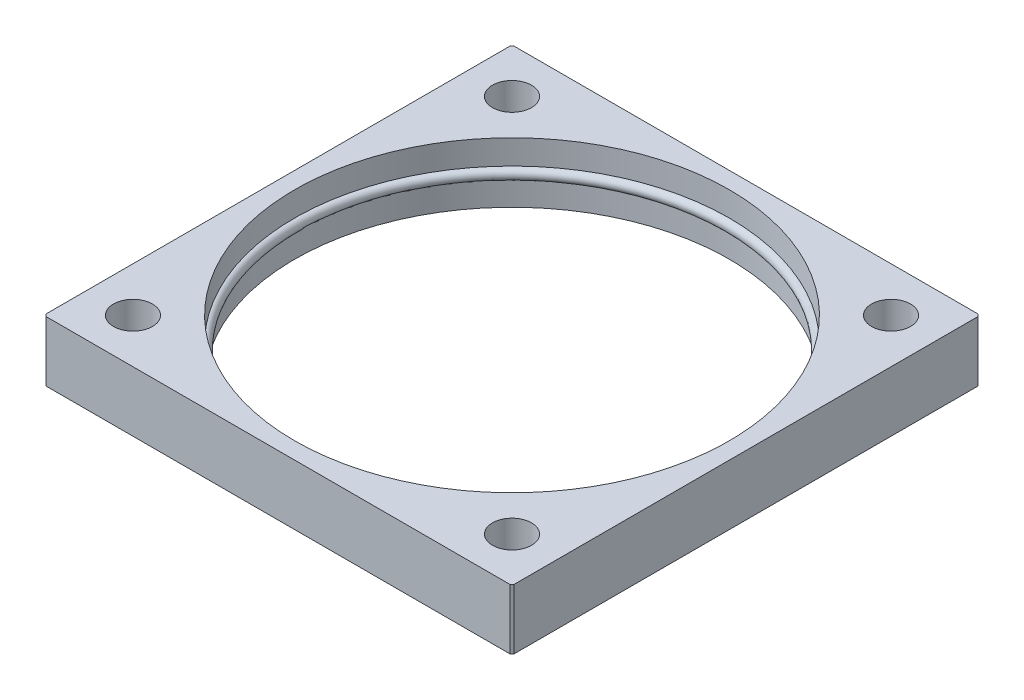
ISO-10303-21;
HEADER;
FILE_DESCRIPTION(('STEP AP214'),'2;1');
FILE_NAME('part.step','',(''),(''),'','','');
FILE_SCHEMA(('AUTOMOTIVE_DESIGN { 1 0 10303 214 1 1 1 1 }'));
ENDSEC;
DATA;
#1=APPLICATION_CONTEXT('core data for automotive mechanical design processes');
#2=APPLICATION_PROTOCOL_DEFINITION('international standard','automotive_design',2000,#1);
#3=PRODUCT_CONTEXT('',#1,'mechanical');
#4=PRODUCT('Part','Part','',(#3));
#5=PRODUCT_RELATED_PRODUCT_CATEGORY('part','',(#4));
#6=PRODUCT_DEFINITION_FORMATION('','',#4);
#7=PRODUCT_DEFINITION_CONTEXT('part definition',#1,'design');
#8=PRODUCT_DEFINITION('design','',#6,#7);
#9=PRODUCT_DEFINITION_SHAPE('','',#8);
#10=(LENGTH_UNIT() NAMED_UNIT(*) SI_UNIT(.MILLI.,.METRE.));
#11=(NAMED_UNIT(*) PLANE_ANGLE_UNIT() SI_UNIT($,.RADIAN.));
#12=(NAMED_UNIT(*) SI_UNIT($,.STERADIAN.) SOLID_ANGLE_UNIT());
#13=UNCERTAINTY_MEASURE_WITH_UNIT(LENGTH_MEASURE(1.E-05),#10,'distance_accuracy_value','');
#14=(GEOMETRIC_REPRESENTATION_CONTEXT(3) GLOBAL_UNCERTAINTY_ASSIGNED_CONTEXT((#13)) GLOBAL_UNIT_ASSIGNED_CONTEXT((#10,
#11,#12)) REPRESENTATION_CONTEXT('',''));
#15=CARTESIAN_POINT('',(0.,0.,0.));
#16=DIRECTION('',(0.,0.,1.));
#17=DIRECTION('',(1.,0.,0.));
#18=AXIS2_PLACEMENT_3D('',#15,#16,#17);
#19=CARTESIAN_POINT('',(0.,13.5,0.));
#20=DIRECTION('',(0.,-1.,0.));
#21=DIRECTION('',(0.,0.,-1.));
#22=AXIS2_PLACEMENT_3D('',#19,#20,#21);
#23=CYLINDRICAL_SURFACE('',#22,97.5);
#24=CARTESIAN_POINT('',(0.,-13.5,0.));
#25=DIRECTION('',(0.,1.,0.));
#26=DIRECTION('',(0.,0.,1.));
#27=AXIS2_PLACEMENT_3D('',#24,#25,#26);
#28=CIRCLE('',#27,97.5);
#29=CARTESIAN_POINT('',(0.,-13.5,97.5));
#30=VERTEX_POINT('',#29);
#31=EDGE_CURVE('E193',#30,#30,#28,.T.);
#32=ORIENTED_EDGE('',*,*,#31,.F.);
#33=EDGE_LOOP('',(#32));
#34=FACE_BOUND('',#33,.T.);
#35=CARTESIAN_POINT('',(0.,-2.5,0.));
#36=DIRECTION('',(0.,1.,0.));
#37=DIRECTION('',(0.,0.,1.));
#38=AXIS2_PLACEMENT_3D('',#35,#36,#37);
#39=CIRCLE('',#38,97.5);
#40=CARTESIAN_POINT('',(0.,-2.5,97.5));
#41=VERTEX_POINT('',#40);
#42=EDGE_CURVE('E39',#41,#41,#39,.T.);
#43=ORIENTED_EDGE('',*,*,#42,.T.);
#44=EDGE_LOOP('',(#43));
#45=FACE_BOUND('',#44,.T.);
#46=ADVANCED_FACE('F35',(#34,#45),#23,.F.);
#47=CARTESIAN_POINT('',(0.,13.5,0.));
#48=DIRECTION('',(0.,1.,0.));
#49=DIRECTION('',(0.,0.,1.));
#50=AXIS2_PLACEMENT_3D('',#47,#48,#49);
#51=CIRCLE('',#50,97.5);
#52=CARTESIAN_POINT('',(0.,13.5,97.5));
#53=VERTEX_POINT('',#52);
#54=EDGE_CURVE('E139',#53,#53,#51,.T.);
#55=ORIENTED_EDGE('',*,*,#54,.T.);
#56=EDGE_LOOP('',(#55));
#57=FACE_BOUND('',#56,.T.);
#58=CARTESIAN_POINT('',(0.,2.5,0.));
#59=DIRECTION('',(0.,-1.,0.));
#60=DIRECTION('',(0.,0.,-1.));
#61=AXIS2_PLACEMENT_3D('',#58,#59,#60);
#62=CIRCLE('',#61,97.5);
#63=CARTESIAN_POINT('',(0.,2.5,-97.5));
#64=VERTEX_POINT('',#63);
#65=EDGE_CURVE('E161',#64,#64,#62,.T.);
#66=ORIENTED_EDGE('',*,*,#65,.T.);
#67=EDGE_LOOP('',(#66));
#68=FACE_BOUND('',#67,.T.);
#69=ADVANCED_FACE('F237',(#57,#68),#23,.F.);
#70=CARTESIAN_POINT('',(0.,13.5,0.));
#71=DIRECTION('',(0.,1.,0.));
#72=DIRECTION('',(0.,0.,1.));
#73=AXIS2_PLACEMENT_3D('',#70,#71,#72);
#74=PLANE('',#73);
#75=CARTESIAN_POINT('',(85.,13.5,85.));
#76=DIRECTION('',(0.,1.,0.));
#77=DIRECTION('',(0.,0.,1.));
#78=AXIS2_PLACEMENT_3D('',#75,#76,#77);
#79=CIRCLE('',#78,8.75000000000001);
#80=CARTESIAN_POINT('',(85.,13.5,93.75));
#81=VERTEX_POINT('',#80);
#82=EDGE_CURVE('E178',#81,#81,#79,.T.);
#83=ORIENTED_EDGE('',*,*,#82,.F.);
#84=EDGE_LOOP('',(#83));
#85=FACE_BOUND('',#84,.T.);
#86=CARTESIAN_POINT('',(85.,13.5,-85.0000000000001));
#87=DIRECTION('',(0.,1.,0.));
#88=DIRECTION('',(0.,0.,1.));
#89=AXIS2_PLACEMENT_3D('',#86,#87,#88);
#90=CIRCLE('',#89,8.75000000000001);
#91=CARTESIAN_POINT('',(85.,13.5,-76.2500000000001));
#92=VERTEX_POINT('',#91);
#93=EDGE_CURVE('E190',#92,#92,#90,.T.);
#94=ORIENTED_EDGE('',*,*,#93,.F.);
#95=EDGE_LOOP('',(#94));
#96=FACE_BOUND('',#95,.T.);
#97=DIRECTION('',(-1.,0.,0.));
#98=VECTOR('',#97,1.);
#99=CARTESIAN_POINT('',(-104.,13.5,-105.));
#100=LINE('',#99,#98);
#101=CARTESIAN_POINT('',(104.,13.5,-105.));
#102=VERTEX_POINT('',#101);
#103=CARTESIAN_POINT('',(-104.,13.5,-105.));
#104=VERTEX_POINT('',#103);
#105=EDGE_CURVE('E150',#102,#104,#100,.T.);
#106=ORIENTED_EDGE('',*,*,#105,.T.);
#107=DIRECTION('',(-0.707106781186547,0.,0.707106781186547));
#108=VECTOR('',#107,1.);
#109=CARTESIAN_POINT('',(-105.,13.5,-104.));
#110=LINE('',#109,#108);
#111=CARTESIAN_POINT('',(-105.,13.5,-104.));
#112=VERTEX_POINT('',#111);
#113=EDGE_CURVE('E97',#104,#112,#110,.T.);
#114=ORIENTED_EDGE('',*,*,#113,.T.);
#115=DIRECTION('',(0.,0.,1.));
#116=VECTOR('',#115,1.);
#117=CARTESIAN_POINT('',(-105.,13.5,104.));
#118=LINE('',#117,#116);
#119=CARTESIAN_POINT('',(-105.,13.5,104.));
#120=VERTEX_POINT('',#119);
#121=EDGE_CURVE('E202',#112,#120,#118,.T.);
#122=ORIENTED_EDGE('',*,*,#121,.T.);
#123=DIRECTION('',(0.707106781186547,0.,0.707106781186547));
#124=VECTOR('',#123,1.);
#125=CARTESIAN_POINT('',(-104.,13.5,105.));
#126=LINE('',#125,#124);
#127=CARTESIAN_POINT('',(-104.,13.5,105.));
#128=VERTEX_POINT('',#127);
#129=EDGE_CURVE('E204',#120,#128,#126,.T.);
#130=ORIENTED_EDGE('',*,*,#129,.T.);
#131=DIRECTION('',(1.,0.,0.));
#132=VECTOR('',#131,1.);
#133=CARTESIAN_POINT('',(-104.,13.5,105.));
#134=LINE('',#133,#132);
#135=CARTESIAN_POINT('',(104.,13.5,105.));
#136=VERTEX_POINT('',#135);
#137=EDGE_CURVE('E117',#128,#136,#134,.T.);
#138=ORIENTED_EDGE('',*,*,#137,.T.);
#139=DIRECTION('',(0.707106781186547,0.,-0.707106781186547));
#140=VECTOR('',#139,1.);
#141=CARTESIAN_POINT('',(104.,13.5,105.));
#142=LINE('',#141,#140);
#143=CARTESIAN_POINT('',(105.,13.5,104.));
#144=VERTEX_POINT('',#143);
#145=EDGE_CURVE('E110',#136,#144,#142,.T.);
#146=ORIENTED_EDGE('',*,*,#145,.T.);
#147=DIRECTION('',(0.,0.,-1.));
#148=VECTOR('',#147,1.);
#149=CARTESIAN_POINT('',(105.,13.5,104.));
#150=LINE('',#149,#148);
#151=CARTESIAN_POINT('',(105.,13.5,-104.));
#152=VERTEX_POINT('',#151);
#153=EDGE_CURVE('E115',#144,#152,#150,.T.);
#154=ORIENTED_EDGE('',*,*,#153,.T.);
#155=DIRECTION('',(-0.707106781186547,0.,-0.707106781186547));
#156=VECTOR('',#155,1.);
#157=CARTESIAN_POINT('',(104.,13.5,-105.));
#158=LINE('',#157,#156);
#159=EDGE_CURVE('E54',#152,#102,#158,.T.);
#160=ORIENTED_EDGE('',*,*,#159,.T.);
#161=EDGE_LOOP('',(#106,#114,#122,#130,#138,#146,#154,#160));
#162=FACE_BOUND('',#161,.T.);
#163=ORIENTED_EDGE('',*,*,#54,.F.);
#164=EDGE_LOOP('',(#163));
#165=FACE_BOUND('',#164,.T.);
#166=CARTESIAN_POINT('',(-85.,13.5,-85.));
#167=DIRECTION('',(0.,1.,0.));
#168=DIRECTION('',(0.,0.,1.));
#169=AXIS2_PLACEMENT_3D('',#166,#167,#168);
#170=CIRCLE('',#169,8.74999999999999);
#171=CARTESIAN_POINT('',(-85.,13.5,-76.2500000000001));
#172=VERTEX_POINT('',#171);
#173=EDGE_CURVE('E184',#172,#172,#170,.T.);
#174=ORIENTED_EDGE('',*,*,#173,.F.);
#175=EDGE_LOOP('',(#174));
#176=FACE_BOUND('',#175,.T.);
#177=CARTESIAN_POINT('',(-85.,13.5,85.));
#178=DIRECTION('',(0.,1.,0.));
#179=DIRECTION('',(0.,0.,1.));
#180=AXIS2_PLACEMENT_3D('',#177,#178,#179);
#181=CIRCLE('',#180,8.75000000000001);
#182=CARTESIAN_POINT('',(-85.,13.5,93.75));
#183=VERTEX_POINT('',#182);
#184=EDGE_CURVE('E170',#183,#183,#181,.T.);
#185=ORIENTED_EDGE('',*,*,#184,.F.);
#186=EDGE_LOOP('',(#185));
#187=FACE_BOUND('',#186,.T.);
#188=ADVANCED_FACE('F112',(#85,#96,#162,#165,#176,#187),#74,.T.);
#189=CARTESIAN_POINT('',(0.,-13.5,0.));
#190=DIRECTION('',(0.,1.,0.));
#191=DIRECTION('',(0.,0.,1.));
#192=AXIS2_PLACEMENT_3D('',#189,#190,#191);
#193=PLANE('',#192);
#194=DIRECTION('',(-1.,0.,0.));
#195=VECTOR('',#194,1.);
#196=CARTESIAN_POINT('',(-104.,-13.5,-105.));
#197=LINE('',#196,#195);
#198=CARTESIAN_POINT('',(104.,-13.5,-105.));
#199=VERTEX_POINT('',#198);
#200=CARTESIAN_POINT('',(-104.,-13.5,-105.));
#201=VERTEX_POINT('',#200);
#202=EDGE_CURVE('E135',#199,#201,#197,.T.);
#203=ORIENTED_EDGE('',*,*,#202,.F.);
#204=DIRECTION('',(-0.707106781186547,0.,-0.707106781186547));
#205=VECTOR('',#204,1.);
#206=CARTESIAN_POINT('',(104.,-13.5,-105.));
#207=LINE('',#206,#205);
#208=CARTESIAN_POINT('',(105.,-13.5,-104.));
#209=VERTEX_POINT('',#208);
#210=EDGE_CURVE('E89',#209,#199,#207,.T.);
#211=ORIENTED_EDGE('',*,*,#210,.F.);
#212=DIRECTION('',(0.,0.,-1.));
#213=VECTOR('',#212,1.);
#214=CARTESIAN_POINT('',(105.,-13.5,104.));
#215=LINE('',#214,#213);
#216=CARTESIAN_POINT('',(105.,-13.5,104.));
#217=VERTEX_POINT('',#216);
#218=EDGE_CURVE('E83',#217,#209,#215,.T.);
#219=ORIENTED_EDGE('',*,*,#218,.F.);
#220=DIRECTION('',(0.707106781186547,0.,-0.707106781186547));
#221=VECTOR('',#220,1.);
#222=CARTESIAN_POINT('',(104.,-13.5,105.));
#223=LINE('',#222,#221);
#224=CARTESIAN_POINT('',(104.,-13.5,105.));
#225=VERTEX_POINT('',#224);
#226=EDGE_CURVE('E125',#225,#217,#223,.T.);
#227=ORIENTED_EDGE('',*,*,#226,.F.);
#228=DIRECTION('',(1.,0.,0.));
#229=VECTOR('',#228,1.);
#230=CARTESIAN_POINT('',(-104.,-13.5,105.));
#231=LINE('',#230,#229);
#232=CARTESIAN_POINT('',(-104.,-13.5,105.));
#233=VERTEX_POINT('',#232);
#234=EDGE_CURVE('E145',#233,#225,#231,.T.);
#235=ORIENTED_EDGE('',*,*,#234,.F.);
#236=DIRECTION('',(0.707106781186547,0.,0.707106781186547));
#237=VECTOR('',#236,1.);
#238=CARTESIAN_POINT('',(-104.,-13.5,105.));
#239=LINE('',#238,#237);
#240=CARTESIAN_POINT('',(-105.,-13.5,104.));
#241=VERTEX_POINT('',#240);
#242=EDGE_CURVE('E143',#241,#233,#239,.T.);
#243=ORIENTED_EDGE('',*,*,#242,.F.);
#244=DIRECTION('',(0.,0.,1.));
#245=VECTOR('',#244,1.);
#246=CARTESIAN_POINT('',(-105.,-13.5,104.));
#247=LINE('',#246,#245);
#248=CARTESIAN_POINT('',(-105.,-13.5,-104.));
#249=VERTEX_POINT('',#248);
#250=EDGE_CURVE('E141',#249,#241,#247,.T.);
#251=ORIENTED_EDGE('',*,*,#250,.F.);
#252=DIRECTION('',(-0.707106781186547,0.,0.707106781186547));
#253=VECTOR('',#252,1.);
#254=CARTESIAN_POINT('',(-105.,-13.5,-104.));
#255=LINE('',#254,#253);
#256=EDGE_CURVE('E138',#201,#249,#255,.T.);
#257=ORIENTED_EDGE('',*,*,#256,.F.);
#258=EDGE_LOOP('',(#203,#211,#219,#227,#235,#243,#251,#257));
#259=FACE_BOUND('',#258,.T.);
#260=ORIENTED_EDGE('',*,*,#31,.T.);
#261=EDGE_LOOP('',(#260));
#262=FACE_BOUND('',#261,.T.);
#263=CARTESIAN_POINT('',(85.,-13.5,-85.0000000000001));
#264=DIRECTION('',(0.,1.,0.));
#265=DIRECTION('',(0.,0.,1.));
#266=AXIS2_PLACEMENT_3D('',#263,#264,#265);
#267=CIRCLE('',#266,8.75000000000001);
#268=CARTESIAN_POINT('',(85.,-13.5,-76.2500000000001));
#269=VERTEX_POINT('',#268);
#270=EDGE_CURVE('E187',#269,#269,#267,.T.);
#271=ORIENTED_EDGE('',*,*,#270,.T.);
#272=EDGE_LOOP('',(#271));
#273=FACE_BOUND('',#272,.T.);
#274=CARTESIAN_POINT('',(-85.,-13.5,-85.));
#275=DIRECTION('',(0.,1.,0.));
#276=DIRECTION('',(0.,0.,1.));
#277=AXIS2_PLACEMENT_3D('',#274,#275,#276);
#278=CIRCLE('',#277,8.74999999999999);
#279=CARTESIAN_POINT('',(-85.,-13.5,-76.2500000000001));
#280=VERTEX_POINT('',#279);
#281=EDGE_CURVE('E181',#280,#280,#278,.T.);
#282=ORIENTED_EDGE('',*,*,#281,.T.);
#283=EDGE_LOOP('',(#282));
#284=FACE_BOUND('',#283,.T.);
#285=CARTESIAN_POINT('',(85.,-13.5,85.));
#286=DIRECTION('',(0.,1.,0.));
#287=DIRECTION('',(0.,0.,1.));
#288=AXIS2_PLACEMENT_3D('',#285,#286,#287);
#289=CIRCLE('',#288,8.75000000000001);
#290=CARTESIAN_POINT('',(85.,-13.5,93.75));
#291=VERTEX_POINT('',#290);
#292=EDGE_CURVE('E175',#291,#291,#289,.T.);
#293=ORIENTED_EDGE('',*,*,#292,.T.);
#294=EDGE_LOOP('',(#293));
#295=FACE_BOUND('',#294,.T.);
#296=CARTESIAN_POINT('',(-85.,-13.5,85.));
#297=DIRECTION('',(0.,1.,0.));
#298=DIRECTION('',(0.,0.,1.));
#299=AXIS2_PLACEMENT_3D('',#296,#297,#298);
#300=CIRCLE('',#299,8.75000000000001);
#301=CARTESIAN_POINT('',(-85.,-13.5,93.75));
#302=VERTEX_POINT('',#301);
#303=EDGE_CURVE('E166',#302,#302,#300,.T.);
#304=ORIENTED_EDGE('',*,*,#303,.T.);
#305=EDGE_LOOP('',(#304));
#306=FACE_BOUND('',#305,.T.);
#307=ADVANCED_FACE('F217',(#259,#262,#273,#284,#295,#306),#193,.F.);
#308=CARTESIAN_POINT('',(-104.,13.5,-105.));
#309=DIRECTION('',(0.,0.,1.));
#310=DIRECTION('',(1.,0.,0.));
#311=AXIS2_PLACEMENT_3D('',#308,#309,#310);
#312=PLANE('',#311);
#313=ORIENTED_EDGE('',*,*,#202,.T.);
#314=DIRECTION('',(0.,-1.,0.));
#315=VECTOR('',#314,1.);
#316=CARTESIAN_POINT('',(-104.,13.5,-105.));
#317=LINE('',#316,#315);
#318=EDGE_CURVE('E11',#104,#201,#317,.T.);
#319=ORIENTED_EDGE('',*,*,#318,.F.);
#320=ORIENTED_EDGE('',*,*,#105,.F.);
#321=DIRECTION('',(0.,-1.,0.));
#322=VECTOR('',#321,1.);
#323=CARTESIAN_POINT('',(104.,13.5,-105.));
#324=LINE('',#323,#322);
#325=EDGE_CURVE('E131',#102,#199,#324,.T.);
#326=ORIENTED_EDGE('',*,*,#325,.T.);
#327=EDGE_LOOP('',(#313,#319,#320,#326));
#328=FACE_BOUND('',#327,.T.);
#329=ADVANCED_FACE('F37',(#328),#312,.F.);
#330=CARTESIAN_POINT('',(-105.,13.5,-104.));
#331=DIRECTION('',(0.707106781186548,0.,0.707106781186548));
#332=DIRECTION('',(0.707106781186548,0.,-0.707106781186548));
#333=AXIS2_PLACEMENT_3D('',#330,#331,#332);
#334=PLANE('',#333);
#335=ORIENTED_EDGE('',*,*,#256,.T.);
#336=DIRECTION('',(0.,-1.,0.));
#337=VECTOR('',#336,1.);
#338=CARTESIAN_POINT('',(-105.,13.5,-104.));
#339=LINE('',#338,#337);
#340=EDGE_CURVE('E45',#112,#249,#339,.T.);
#341=ORIENTED_EDGE('',*,*,#340,.F.);
#342=ORIENTED_EDGE('',*,*,#113,.F.);
#343=ORIENTED_EDGE('',*,*,#318,.T.);
#344=EDGE_LOOP('',(#335,#341,#342,#343));
#345=FACE_BOUND('',#344,.T.);
#346=ADVANCED_FACE('F253',(#345),#334,.F.);
#347=CARTESIAN_POINT('',(-105.,13.5,104.));
#348=DIRECTION('',(1.,0.,0.));
#349=DIRECTION('',(0.,0.,-1.));
#350=AXIS2_PLACEMENT_3D('',#347,#348,#349);
#351=PLANE('',#350);
#352=ORIENTED_EDGE('',*,*,#250,.T.);
#353=DIRECTION('',(0.,-1.,0.));
#354=VECTOR('',#353,1.);
#355=CARTESIAN_POINT('',(-105.,13.5,104.));
#356=LINE('',#355,#354);
#357=EDGE_CURVE('E157',#120,#241,#356,.T.);
#358=ORIENTED_EDGE('',*,*,#357,.F.);
#359=ORIENTED_EDGE('',*,*,#121,.F.);
#360=ORIENTED_EDGE('',*,*,#340,.T.);
#361=EDGE_LOOP('',(#352,#358,#359,#360));
#362=FACE_BOUND('',#361,.T.);
#363=ADVANCED_FACE('F257',(#362),#351,.F.);
#364=CARTESIAN_POINT('',(-104.,13.5,105.));
#365=DIRECTION('',(0.707106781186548,0.,-0.707106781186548));
#366=DIRECTION('',(-0.707106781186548,0.,-0.707106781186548));
#367=AXIS2_PLACEMENT_3D('',#364,#365,#366);
#368=PLANE('',#367);
#369=ORIENTED_EDGE('',*,*,#242,.T.);
#370=DIRECTION('',(0.,-1.,0.));
#371=VECTOR('',#370,1.);
#372=CARTESIAN_POINT('',(-104.,13.5,105.));
#373=LINE('',#372,#371);
#374=EDGE_CURVE('E154',#128,#233,#373,.T.);
#375=ORIENTED_EDGE('',*,*,#374,.F.);
#376=ORIENTED_EDGE('',*,*,#129,.F.);
#377=ORIENTED_EDGE('',*,*,#357,.T.);
#378=EDGE_LOOP('',(#369,#375,#376,#377));
#379=FACE_BOUND('',#378,.T.);
#380=ADVANCED_FACE('F210',(#379),#368,.F.);
#381=CARTESIAN_POINT('',(-104.,13.5,105.));
#382=DIRECTION('',(0.,0.,-1.));
#383=DIRECTION('',(-1.,0.,0.));
#384=AXIS2_PLACEMENT_3D('',#381,#382,#383);
#385=PLANE('',#384);
#386=ORIENTED_EDGE('',*,*,#234,.T.);
#387=DIRECTION('',(0.,-1.,0.));
#388=VECTOR('',#387,1.);
#389=CARTESIAN_POINT('',(104.,13.5,105.));
#390=LINE('',#389,#388);
#391=EDGE_CURVE('E126',#136,#225,#390,.T.);
#392=ORIENTED_EDGE('',*,*,#391,.F.);
#393=ORIENTED_EDGE('',*,*,#137,.F.);
#394=ORIENTED_EDGE('',*,*,#374,.T.);
#395=EDGE_LOOP('',(#386,#392,#393,#394));
#396=FACE_BOUND('',#395,.T.);
#397=ADVANCED_FACE('F214',(#396),#385,.F.);
#398=CARTESIAN_POINT('',(104.,13.5,105.));
#399=DIRECTION('',(-0.707106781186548,0.,-0.707106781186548));
#400=DIRECTION('',(-0.707106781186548,0.,0.707106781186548));
#401=AXIS2_PLACEMENT_3D('',#398,#399,#400);
#402=PLANE('',#401);
#403=ORIENTED_EDGE('',*,*,#226,.T.);
#404=DIRECTION('',(0.,-1.,0.));
#405=VECTOR('',#404,1.);
#406=CARTESIAN_POINT('',(105.,13.5,104.));
#407=LINE('',#406,#405);
#408=EDGE_CURVE('E122',#144,#217,#407,.T.);
#409=ORIENTED_EDGE('',*,*,#408,.F.);
#410=ORIENTED_EDGE('',*,*,#145,.F.);
#411=ORIENTED_EDGE('',*,*,#391,.T.);
#412=EDGE_LOOP('',(#403,#409,#410,#411));
#413=FACE_BOUND('',#412,.T.);
#414=ADVANCED_FACE('F123',(#413),#402,.F.);
#415=CARTESIAN_POINT('',(105.,13.5,104.));
#416=DIRECTION('',(-1.,0.,0.));
#417=DIRECTION('',(0.,0.,1.));
#418=AXIS2_PLACEMENT_3D('',#415,#416,#417);
#419=PLANE('',#418);
#420=ORIENTED_EDGE('',*,*,#218,.T.);
#421=DIRECTION('',(0.,-1.,0.));
#422=VECTOR('',#421,1.);
#423=CARTESIAN_POINT('',(105.,13.5,-104.));
#424=LINE('',#423,#422);
#425=EDGE_CURVE('E127',#152,#209,#424,.T.);
#426=ORIENTED_EDGE('',*,*,#425,.F.);
#427=ORIENTED_EDGE('',*,*,#153,.F.);
#428=ORIENTED_EDGE('',*,*,#408,.T.);
#429=EDGE_LOOP('',(#420,#426,#427,#428));
#430=FACE_BOUND('',#429,.T.);
#431=ADVANCED_FACE('F129',(#430),#419,.F.);
#432=CARTESIAN_POINT('',(104.,13.5,-105.));
#433=DIRECTION('',(-0.707106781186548,0.,0.707106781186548));
#434=DIRECTION('',(0.707106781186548,0.,0.707106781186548));
#435=AXIS2_PLACEMENT_3D('',#432,#433,#434);
#436=PLANE('',#435);
#437=ORIENTED_EDGE('',*,*,#210,.T.);
#438=ORIENTED_EDGE('',*,*,#325,.F.);
#439=ORIENTED_EDGE('',*,*,#159,.F.);
#440=ORIENTED_EDGE('',*,*,#425,.T.);
#441=EDGE_LOOP('',(#437,#438,#439,#440));
#442=FACE_BOUND('',#441,.T.);
#443=ADVANCED_FACE('F223',(#442),#436,.F.);
#444=CARTESIAN_POINT('',(85.,13.5,-85.0000000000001));
#445=DIRECTION('',(0.,-1.,0.));
#446=DIRECTION('',(0.,0.,-1.));
#447=AXIS2_PLACEMENT_3D('',#444,#445,#446);
#448=CYLINDRICAL_SURFACE('',#447,8.75000000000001);
#449=ORIENTED_EDGE('',*,*,#93,.T.);
#450=EDGE_LOOP('',(#449));
#451=FACE_BOUND('',#450,.T.);
#452=ORIENTED_EDGE('',*,*,#270,.F.);
#453=EDGE_LOOP('',(#452));
#454=FACE_BOUND('',#453,.T.);
#455=ADVANCED_FACE('F225',(#451,#454),#448,.F.);
#456=CARTESIAN_POINT('',(-85.,13.5,-85.));
#457=DIRECTION('',(0.,-1.,0.));
#458=DIRECTION('',(0.,0.,-1.));
#459=AXIS2_PLACEMENT_3D('',#456,#457,#458);
#460=CYLINDRICAL_SURFACE('',#459,8.74999999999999);
#461=ORIENTED_EDGE('',*,*,#173,.T.);
#462=EDGE_LOOP('',(#461));
#463=FACE_BOUND('',#462,.T.);
#464=ORIENTED_EDGE('',*,*,#281,.F.);
#465=EDGE_LOOP('',(#464));
#466=FACE_BOUND('',#465,.T.);
#467=ADVANCED_FACE('F231',(#463,#466),#460,.F.);
#468=CARTESIAN_POINT('',(85.,13.5,85.));
#469=DIRECTION('',(0.,-1.,0.));
#470=DIRECTION('',(0.,0.,-1.));
#471=AXIS2_PLACEMENT_3D('',#468,#469,#470);
#472=CYLINDRICAL_SURFACE('',#471,8.75000000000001);
#473=ORIENTED_EDGE('',*,*,#82,.T.);
#474=EDGE_LOOP('',(#473));
#475=FACE_BOUND('',#474,.T.);
#476=ORIENTED_EDGE('',*,*,#292,.F.);
#477=EDGE_LOOP('',(#476));
#478=FACE_BOUND('',#477,.T.);
#479=ADVANCED_FACE('F296',(#475,#478),#472,.F.);
#480=CARTESIAN_POINT('',(-85.,13.5,85.));
#481=DIRECTION('',(0.,-1.,0.));
#482=DIRECTION('',(0.,0.,-1.));
#483=AXIS2_PLACEMENT_3D('',#480,#481,#482);
#484=CYLINDRICAL_SURFACE('',#483,8.75000000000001);
#485=ORIENTED_EDGE('',*,*,#184,.T.);
#486=EDGE_LOOP('',(#485));
#487=FACE_BOUND('',#486,.T.);
#488=ORIENTED_EDGE('',*,*,#303,.F.);
#489=EDGE_LOOP('',(#488));
#490=FACE_BOUND('',#489,.T.);
#491=ADVANCED_FACE('F305',(#487,#490),#484,.F.);
#492=CARTESIAN_POINT('',(0.,0.,0.));
#493=DIRECTION('',(0.,-1.,0.));
#494=DIRECTION('',(0.,0.,-1.));
#495=AXIS2_PLACEMENT_3D('',#492,#493,#494);
#496=TOROIDAL_SURFACE('',#495,97.5,2.5);
#497=ORIENTED_EDGE('',*,*,#65,.F.);
#498=EDGE_LOOP('',(#497));
#499=FACE_BOUND('',#498,.T.);
#500=ORIENTED_EDGE('',*,*,#42,.F.);
#501=EDGE_LOOP('',(#500));
#502=FACE_BOUND('',#501,.T.);
#503=ADVANCED_FACE('F314',(#499,#502),#496,.T.);
#504=CLOSED_SHELL('',(#46,#69,#188,#307,#329,#346,#363,#380,#397,#414,#431,#443,#455,#467,#479,
#491,#503));
#505=MANIFOLD_SOLID_BREP('B2',#504);
#506=ADVANCED_BREP_SHAPE_REPRESENTATION('',(#18,#505),#14);
#507=SHAPE_DEFINITION_REPRESENTATION(#9,#506);
ENDSEC;
END-ISO-10303-21;
